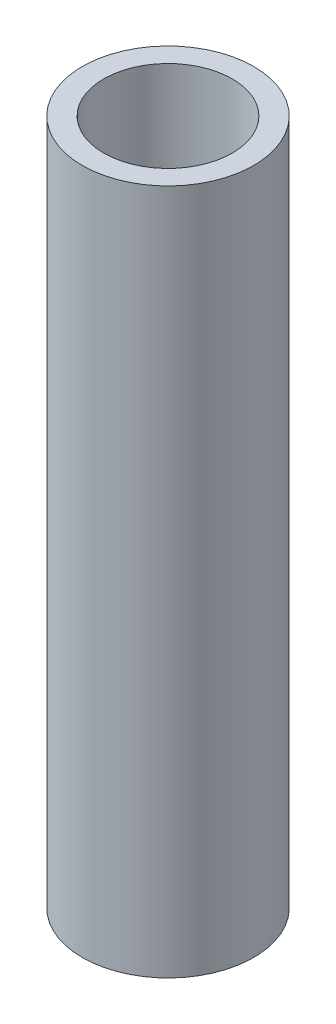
from build123d import *

# Parameters (mm, degrees)
SKETCH2_R           = 25.4
SKETCH2_R_2         = 19.05
BOSS_EXTRUDE1_DEPTH = 203.2


with BuildPart() as part:
    # Sketch2 → Boss-Extrude1 (new body)
    with BuildSketch(Plane(origin=(0, 0, 0), x_dir=(1, 0, 0), z_dir=(0, 1, 0))):
        with Locations(Location((0, 0, 0), (0, 0, 270))):
            Circle(SKETCH2_R)
        with Locations(Location((0, 0, 0), (0, 0, 270))):
            Circle(SKETCH2_R_2, mode=Mode.SUBTRACT)
    extrude(amount=BOSS_EXTRUDE1_DEPTH)


solid = part.part
